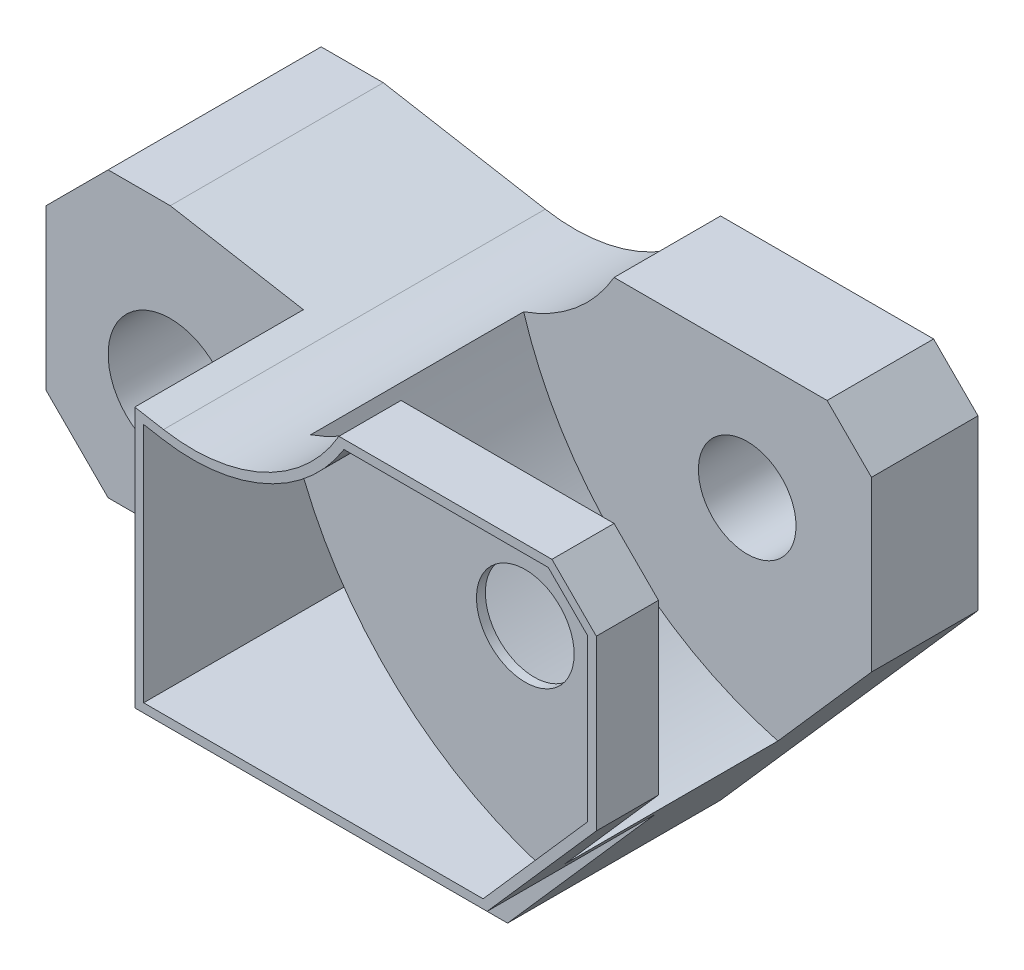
ISO-10303-21;
HEADER;
FILE_DESCRIPTION(('STEP AP214'),'2;1');
FILE_NAME('part.step','',(''),(''),'','','');
FILE_SCHEMA(('AUTOMOTIVE_DESIGN { 1 0 10303 214 1 1 1 1 }'));
ENDSEC;
DATA;
#1=APPLICATION_CONTEXT('core data for automotive mechanical design processes');
#2=APPLICATION_PROTOCOL_DEFINITION('international standard','automotive_design',2000,#1);
#3=PRODUCT_CONTEXT('',#1,'mechanical');
#4=PRODUCT('Part','Part','',(#3));
#5=PRODUCT_RELATED_PRODUCT_CATEGORY('part','',(#4));
#6=PRODUCT_DEFINITION_FORMATION('','',#4);
#7=PRODUCT_DEFINITION_CONTEXT('part definition',#1,'design');
#8=PRODUCT_DEFINITION('design','',#6,#7);
#9=PRODUCT_DEFINITION_SHAPE('','',#8);
#10=(LENGTH_UNIT() NAMED_UNIT(*) SI_UNIT(.MILLI.,.METRE.));
#11=(NAMED_UNIT(*) PLANE_ANGLE_UNIT() SI_UNIT($,.RADIAN.));
#12=(NAMED_UNIT(*) SI_UNIT($,.STERADIAN.) SOLID_ANGLE_UNIT());
#13=UNCERTAINTY_MEASURE_WITH_UNIT(LENGTH_MEASURE(1.E-05),#10,'distance_accuracy_value','');
#14=(GEOMETRIC_REPRESENTATION_CONTEXT(3) GLOBAL_UNCERTAINTY_ASSIGNED_CONTEXT((#13)) GLOBAL_UNIT_ASSIGNED_CONTEXT((#10,
#11,#12)) REPRESENTATION_CONTEXT('',''));
#15=CARTESIAN_POINT('',(0.,0.,0.));
#16=DIRECTION('',(0.,0.,1.));
#17=DIRECTION('',(1.,0.,0.));
#18=AXIS2_PLACEMENT_3D('',#15,#16,#17);
#19=CARTESIAN_POINT('',(21.5424003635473,33.4945992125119,43.));
#20=DIRECTION('',(0.,0.,-1.));
#21=DIRECTION('',(-1.,0.,0.));
#22=AXIS2_PLACEMENT_3D('',#19,#20,#21);
#23=PLANE('',#22);
#24=DIRECTION('',(1.,0.,0.));
#25=VECTOR('',#24,1.);
#26=CARTESIAN_POINT('',(21.0666262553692,-14.,43.));
#27=LINE('',#26,#25);
#28=CARTESIAN_POINT('',(15.,-14.,43.));
#29=VERTEX_POINT('',#28);
#30=CARTESIAN_POINT('',(54.6969696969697,-14.,43.));
#31=VERTEX_POINT('',#30);
#32=EDGE_CURVE('E431',#29,#31,#27,.T.);
#33=ORIENTED_EDGE('',*,*,#32,.T.);
#34=DIRECTION('',(0.660114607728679,0.751164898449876,0.));
#35=VECTOR('',#34,1.);
#36=CARTESIAN_POINT('',(67.,0.,43.));
#37=LINE('',#36,#35);
#38=CARTESIAN_POINT('',(67.,0.,43.));
#39=VERTEX_POINT('',#38);
#40=EDGE_CURVE('E433',#31,#39,#37,.T.);
#41=ORIENTED_EDGE('',*,*,#40,.T.);
#42=DIRECTION('',(0.,1.,0.));
#43=VECTOR('',#42,1.);
#44=CARTESIAN_POINT('',(67.,19.,43.));
#45=LINE('',#44,#43);
#46=CARTESIAN_POINT('',(67.,19.,43.));
#47=VERTEX_POINT('',#46);
#48=EDGE_CURVE('E436',#39,#47,#45,.T.);
#49=ORIENTED_EDGE('',*,*,#48,.T.);
#50=DIRECTION('',(-0.707106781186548,0.707106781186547,0.));
#51=VECTOR('',#50,1.);
#52=CARTESIAN_POINT('',(62.,24.,43.));
#53=LINE('',#52,#51);
#54=CARTESIAN_POINT('',(62.,24.,43.));
#55=VERTEX_POINT('',#54);
#56=EDGE_CURVE('E438',#47,#55,#53,.T.);
#57=ORIENTED_EDGE('',*,*,#56,.T.);
#58=DIRECTION('',(-1.,0.,0.));
#59=VECTOR('',#58,1.);
#60=CARTESIAN_POINT('',(38.,24.,43.));
#61=LINE('',#60,#59);
#62=CARTESIAN_POINT('',(38.,24.,43.));
#63=VERTEX_POINT('',#62);
#64=EDGE_CURVE('E440',#55,#63,#61,.T.);
#65=ORIENTED_EDGE('',*,*,#64,.T.);
#66=CARTESIAN_POINT('',(21.5424003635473,33.4945992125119,43.));
#67=DIRECTION('',(0.,0.,-1.));
#68=DIRECTION('',(-1.,0.,0.));
#69=AXIS2_PLACEMENT_3D('',#66,#67,#68);
#70=CIRCLE('',#69,19.);
#71=CARTESIAN_POINT('',(18.2430849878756,14.78325190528,43.));
#72=VERTEX_POINT('',#71);
#73=EDGE_CURVE('E442',#63,#72,#70,.T.);
#74=ORIENTED_EDGE('',*,*,#73,.T.);
#75=DIRECTION('',(-0.984807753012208,0.173648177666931,0.));
#76=VECTOR('',#75,1.);
#77=CARTESIAN_POINT('',(0.,18.,43.));
#78=LINE('',#77,#76);
#79=CARTESIAN_POINT('',(15.,15.355095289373,43.));
#80=VERTEX_POINT('',#79);
#81=EDGE_CURVE('E444',#72,#80,#78,.T.);
#82=ORIENTED_EDGE('',*,*,#81,.T.);
#83=DIRECTION('',(0.,1.,0.));
#84=VECTOR('',#83,1.);
#85=CARTESIAN_POINT('',(15.,0.,43.));
#86=LINE('',#85,#84);
#87=EDGE_CURVE('E389',#29,#80,#86,.T.);
#88=ORIENTED_EDGE('',*,*,#87,.F.);
#89=EDGE_LOOP('',(#33,#41,#49,#57,#65,#74,#82,#88));
#90=FACE_BOUND('',#89,.T.);
#91=DIRECTION('',(0.660114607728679,0.751164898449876,0.));
#92=VECTOR('',#91,1.);
#93=CARTESIAN_POINT('',(37.0534983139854,-32.5621651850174,43.));
#94=LINE('',#93,#92);
#95=CARTESIAN_POINT('',(54.2444919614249,-13.,43.));
#96=VERTEX_POINT('',#95);
#97=CARTESIAN_POINT('',(66.,0.376957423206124,43.));
#98=VERTEX_POINT('',#97);
#99=EDGE_CURVE('E327',#96,#98,#94,.T.);
#100=ORIENTED_EDGE('',*,*,#99,.F.);
#101=DIRECTION('',(1.,0.,0.));
#102=VECTOR('',#101,1.);
#103=CARTESIAN_POINT('',(0.,-13.,43.));
#104=LINE('',#103,#102);
#105=CARTESIAN_POINT('',(16.,-13.,43.));
#106=VERTEX_POINT('',#105);
#107=EDGE_CURVE('E277',#106,#96,#104,.T.);
#108=ORIENTED_EDGE('',*,*,#107,.F.);
#109=DIRECTION('',(0.,1.,0.));
#110=VECTOR('',#109,1.);
#111=CARTESIAN_POINT('',(16.,0.,43.));
#112=LINE('',#111,#110);
#113=CARTESIAN_POINT('',(16.,14.1633416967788,43.));
#114=VERTEX_POINT('',#113);
#115=EDGE_CURVE('E280',#106,#114,#112,.T.);
#116=ORIENTED_EDGE('',*,*,#115,.T.);
#117=DIRECTION('',(-0.984807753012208,0.173648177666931,0.));
#118=VECTOR('',#117,1.);
#119=CARTESIAN_POINT('',(2.90453311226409,16.472425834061,43.));
#120=LINE('',#119,#118);
#121=CARTESIAN_POINT('',(18.0694368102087,13.7984441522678,43.));
#122=VERTEX_POINT('',#121);
#123=EDGE_CURVE('E289',#122,#114,#120,.T.);
#124=ORIENTED_EDGE('',*,*,#123,.F.);
#125=CARTESIAN_POINT('',(21.5424003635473,33.4945992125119,43.));
#126=DIRECTION('',(0.,0.,1.));
#127=DIRECTION('',(1.,0.,0.));
#128=AXIS2_PLACEMENT_3D('',#125,#126,#127);
#129=CIRCLE('',#128,20.);
#130=CARTESIAN_POINT('',(38.5677751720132,23.,43.));
#131=VERTEX_POINT('',#130);
#132=EDGE_CURVE('E296',#122,#131,#129,.T.);
#133=ORIENTED_EDGE('',*,*,#132,.T.);
#134=DIRECTION('',(-1.,0.,0.));
#135=VECTOR('',#134,1.);
#136=CARTESIAN_POINT('',(0.,23.,43.));
#137=LINE('',#136,#135);
#138=CARTESIAN_POINT('',(61.5857864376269,23.,43.));
#139=VERTEX_POINT('',#138);
#140=EDGE_CURVE('E309',#139,#131,#137,.T.);
#141=ORIENTED_EDGE('',*,*,#140,.F.);
#142=DIRECTION('',(-0.707106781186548,0.707106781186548,0.));
#143=VECTOR('',#142,1.);
#144=CARTESIAN_POINT('',(42.2928932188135,42.2928932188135,43.));
#145=LINE('',#144,#143);
#146=CARTESIAN_POINT('',(66.,18.5857864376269,43.));
#147=VERTEX_POINT('',#146);
#148=EDGE_CURVE('E333',#147,#139,#145,.T.);
#149=ORIENTED_EDGE('',*,*,#148,.F.);
#150=DIRECTION('',(0.,1.,0.));
#151=VECTOR('',#150,1.);
#152=CARTESIAN_POINT('',(66.,0.,43.));
#153=LINE('',#152,#151);
#154=EDGE_CURVE('E330',#98,#147,#153,.T.);
#155=ORIENTED_EDGE('',*,*,#154,.F.);
#156=EDGE_LOOP('',(#100,#108,#116,#124,#133,#141,#149,#155));
#157=FACE_BOUND('',#156,.T.);
#158=ADVANCED_FACE('F37',(#90,#157),#23,.F.);
#159=CARTESIAN_POINT('',(53.,10.,0.));
#160=DIRECTION('',(0.,0.,1.));
#161=DIRECTION('',(1.,0.,0.));
#162=AXIS2_PLACEMENT_3D('',#159,#160,#161);
#163=CYLINDRICAL_SURFACE('',#162,5.5);
#164=CARTESIAN_POINT('',(53.,10.,36.));
#165=DIRECTION('',(0.,0.,1.));
#166=DIRECTION('',(1.,0.,0.));
#167=AXIS2_PLACEMENT_3D('',#164,#165,#166);
#168=CIRCLE('',#167,5.5);
#169=CARTESIAN_POINT('',(58.5,10.,36.));
#170=VERTEX_POINT('',#169);
#171=EDGE_CURVE('E340',#170,#170,#168,.T.);
#172=ORIENTED_EDGE('',*,*,#171,.F.);
#173=EDGE_LOOP('',(#172));
#174=FACE_BOUND('',#173,.T.);
#175=CARTESIAN_POINT('',(53.,10.,37.));
#176=DIRECTION('',(0.,0.,1.));
#177=DIRECTION('',(1.,0.,0.));
#178=AXIS2_PLACEMENT_3D('',#175,#176,#177);
#179=CIRCLE('',#178,5.5);
#180=CARTESIAN_POINT('',(58.5,10.,37.));
#181=VERTEX_POINT('',#180);
#182=EDGE_CURVE('E305',#181,#181,#179,.F.);
#183=ORIENTED_EDGE('',*,*,#182,.F.);
#184=EDGE_LOOP('',(#183));
#185=FACE_BOUND('',#184,.T.);
#186=ADVANCED_FACE('F632',(#174,#185),#163,.F.);
#187=CARTESIAN_POINT('',(67.,0.,43.));
#188=DIRECTION('',(-0.751164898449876,0.660114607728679,0.));
#189=DIRECTION('',(-0.660114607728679,-0.751164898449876,0.));
#190=AXIS2_PLACEMENT_3D('',#187,#188,#189);
#191=PLANE('',#190);
#192=DIRECTION('',(0.660114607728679,0.751164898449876,0.));
#193=VECTOR('',#192,1.);
#194=CARTESIAN_POINT('',(37.8046632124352,-33.2222797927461,12.));
#195=LINE('',#194,#193);
#196=CARTESIAN_POINT('',(56.4545454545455,-12.,12.));
#197=VERTEX_POINT('',#196);
#198=CARTESIAN_POINT('',(67.,0.,12.));
#199=VERTEX_POINT('',#198);
#200=EDGE_CURVE('E356',#197,#199,#195,.T.);
#201=ORIENTED_EDGE('',*,*,#200,.F.);
#202=DIRECTION('',(0.,0.,1.));
#203=VECTOR('',#202,1.);
#204=CARTESIAN_POINT('',(56.4545454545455,-12.,12.));
#205=LINE('',#204,#203);
#206=CARTESIAN_POINT('',(56.4545454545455,-12.,36.));
#207=VERTEX_POINT('',#206);
#208=EDGE_CURVE('E382',#197,#207,#205,.T.);
#209=ORIENTED_EDGE('',*,*,#208,.T.);
#210=DIRECTION('',(0.660114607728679,0.751164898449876,0.));
#211=VECTOR('',#210,1.);
#212=CARTESIAN_POINT('',(37.8046632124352,-33.2222797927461,36.));
#213=LINE('',#212,#211);
#214=CARTESIAN_POINT('',(67.,0.,36.));
#215=VERTEX_POINT('',#214);
#216=EDGE_CURVE('E371',#207,#215,#213,.T.);
#217=ORIENTED_EDGE('',*,*,#216,.T.);
#218=DIRECTION('',(0.,0.,-1.));
#219=VECTOR('',#218,1.);
#220=CARTESIAN_POINT('',(67.,0.,43.));
#221=LINE('',#220,#219);
#222=EDGE_CURVE('E510',#39,#215,#221,.T.);
#223=ORIENTED_EDGE('',*,*,#222,.F.);
#224=ORIENTED_EDGE('',*,*,#40,.F.);
#225=DIRECTION('',(0.,0.,1.));
#226=VECTOR('',#225,1.);
#227=CARTESIAN_POINT('',(54.6969696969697,-14.,24.));
#228=LINE('',#227,#226);
#229=CARTESIAN_POINT('',(54.6969696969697,-14.,24.));
#230=VERTEX_POINT('',#229);
#231=EDGE_CURVE('E400',#230,#31,#228,.T.);
#232=ORIENTED_EDGE('',*,*,#231,.F.);
#233=DIRECTION('',(0.660114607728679,0.751164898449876,0.));
#234=VECTOR('',#233,1.);
#235=CARTESIAN_POINT('',(37.8046632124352,-33.2222797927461,24.));
#236=LINE('',#235,#234);
#237=CARTESIAN_POINT('',(38.,-33.,24.));
#238=VERTEX_POINT('',#237);
#239=EDGE_CURVE('E398',#238,#230,#236,.T.);
#240=ORIENTED_EDGE('',*,*,#239,.F.);
#241=DIRECTION('',(0.,0.,-1.));
#242=VECTOR('',#241,1.);
#243=CARTESIAN_POINT('',(38.,-33.,43.));
#244=LINE('',#243,#242);
#245=CARTESIAN_POINT('',(38.,-33.,0.));
#246=VERTEX_POINT('',#245);
#247=EDGE_CURVE('E513',#238,#246,#244,.T.);
#248=ORIENTED_EDGE('',*,*,#247,.T.);
#249=DIRECTION('',(0.660114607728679,0.751164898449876,0.));
#250=VECTOR('',#249,1.);
#251=CARTESIAN_POINT('',(67.,0.,0.));
#252=LINE('',#251,#250);
#253=CARTESIAN_POINT('',(67.,0.,0.));
#254=VERTEX_POINT('',#253);
#255=EDGE_CURVE('E462',#246,#254,#252,.T.);
#256=ORIENTED_EDGE('',*,*,#255,.T.);
#257=EDGE_CURVE('E509',#199,#254,#221,.T.);
#258=ORIENTED_EDGE('',*,*,#257,.F.);
#259=EDGE_LOOP('',(#201,#209,#217,#223,#224,#232,#240,#248,#256,#258));
#260=FACE_BOUND('',#259,.T.);
#261=ADVANCED_FACE('F547',(#260),#191,.F.);
#262=CARTESIAN_POINT('',(67.,19.,43.));
#263=DIRECTION('',(-1.,0.,0.));
#264=DIRECTION('',(0.,0.,1.));
#265=AXIS2_PLACEMENT_3D('',#262,#263,#264);
#266=PLANE('',#265);
#267=DIRECTION('',(0.,1.,0.));
#268=VECTOR('',#267,1.);
#269=CARTESIAN_POINT('',(67.,0.,12.));
#270=LINE('',#269,#268);
#271=CARTESIAN_POINT('',(67.,19.,12.));
#272=VERTEX_POINT('',#271);
#273=EDGE_CURVE('E358',#199,#272,#270,.T.);
#274=ORIENTED_EDGE('',*,*,#273,.F.);
#275=ORIENTED_EDGE('',*,*,#257,.T.);
#276=DIRECTION('',(0.,1.,0.));
#277=VECTOR('',#276,1.);
#278=CARTESIAN_POINT('',(67.,19.,0.));
#279=LINE('',#278,#277);
#280=CARTESIAN_POINT('',(67.,19.,0.));
#281=VERTEX_POINT('',#280);
#282=EDGE_CURVE('E465',#254,#281,#279,.T.);
#283=ORIENTED_EDGE('',*,*,#282,.T.);
#284=DIRECTION('',(0.,0.,-1.));
#285=VECTOR('',#284,1.);
#286=CARTESIAN_POINT('',(67.,19.,43.));
#287=LINE('',#286,#285);
#288=EDGE_CURVE('E505',#272,#281,#287,.T.);
#289=ORIENTED_EDGE('',*,*,#288,.F.);
#290=EDGE_LOOP('',(#274,#275,#283,#289));
#291=FACE_BOUND('',#290,.T.);
#292=ADVANCED_FACE('F606',(#291),#266,.F.);
#293=CARTESIAN_POINT('',(62.,24.,43.));
#294=DIRECTION('',(-0.707106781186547,-0.707106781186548,0.));
#295=DIRECTION('',(0.707106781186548,-0.707106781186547,0.));
#296=AXIS2_PLACEMENT_3D('',#293,#294,#295);
#297=PLANE('',#296);
#298=DIRECTION('',(-0.707106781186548,0.707106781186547,0.));
#299=VECTOR('',#298,1.);
#300=CARTESIAN_POINT('',(43.,43.,12.));
#301=LINE('',#300,#299);
#302=CARTESIAN_POINT('',(62.,24.,12.));
#303=VERTEX_POINT('',#302);
#304=EDGE_CURVE('E360',#272,#303,#301,.T.);
#305=ORIENTED_EDGE('',*,*,#304,.F.);
#306=ORIENTED_EDGE('',*,*,#288,.T.);
#307=DIRECTION('',(-0.707106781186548,0.707106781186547,0.));
#308=VECTOR('',#307,1.);
#309=CARTESIAN_POINT('',(62.,24.,0.));
#310=LINE('',#309,#308);
#311=CARTESIAN_POINT('',(62.,24.,0.));
#312=VERTEX_POINT('',#311);
#313=EDGE_CURVE('E468',#281,#312,#310,.T.);
#314=ORIENTED_EDGE('',*,*,#313,.T.);
#315=DIRECTION('',(0.,0.,-1.));
#316=VECTOR('',#315,1.);
#317=CARTESIAN_POINT('',(62.,24.,43.));
#318=LINE('',#317,#316);
#319=EDGE_CURVE('E501',#303,#312,#318,.T.);
#320=ORIENTED_EDGE('',*,*,#319,.F.);
#321=EDGE_LOOP('',(#305,#306,#314,#320));
#322=FACE_BOUND('',#321,.T.);
#323=ADVANCED_FACE('F602',(#322),#297,.F.);
#324=CARTESIAN_POINT('',(38.,24.,43.));
#325=DIRECTION('',(0.,-1.,0.));
#326=DIRECTION('',(0.,0.,-1.));
#327=AXIS2_PLACEMENT_3D('',#324,#325,#326);
#328=PLANE('',#327);
#329=DIRECTION('',(-1.,0.,0.));
#330=VECTOR('',#329,1.);
#331=CARTESIAN_POINT('',(0.,24.,12.));
#332=LINE('',#331,#330);
#333=CARTESIAN_POINT('',(38.,24.,12.));
#334=VERTEX_POINT('',#333);
#335=EDGE_CURVE('E362',#303,#334,#332,.T.);
#336=ORIENTED_EDGE('',*,*,#335,.F.);
#337=ORIENTED_EDGE('',*,*,#319,.T.);
#338=DIRECTION('',(-1.,0.,0.));
#339=VECTOR('',#338,1.);
#340=CARTESIAN_POINT('',(38.,24.,0.));
#341=LINE('',#340,#339);
#342=CARTESIAN_POINT('',(38.,24.,0.));
#343=VERTEX_POINT('',#342);
#344=EDGE_CURVE('E471',#312,#343,#341,.T.);
#345=ORIENTED_EDGE('',*,*,#344,.T.);
#346=DIRECTION('',(0.,0.,-1.));
#347=VECTOR('',#346,1.);
#348=CARTESIAN_POINT('',(38.,24.,43.));
#349=LINE('',#348,#347);
#350=EDGE_CURVE('E497',#334,#343,#349,.T.);
#351=ORIENTED_EDGE('',*,*,#350,.F.);
#352=EDGE_LOOP('',(#336,#337,#345,#351));
#353=FACE_BOUND('',#352,.T.);
#354=ADVANCED_FACE('F597',(#353),#328,.F.);
#355=CARTESIAN_POINT('',(21.5424003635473,33.4945992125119,43.));
#356=DIRECTION('',(0.,0.,-1.));
#357=DIRECTION('',(-1.,0.,0.));
#358=AXIS2_PLACEMENT_3D('',#355,#356,#357);
#359=CYLINDRICAL_SURFACE('',#358,19.);
#360=CARTESIAN_POINT('',(21.5424003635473,33.4945992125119,12.));
#361=DIRECTION('',(0.,0.,1.));
#362=DIRECTION('',(1.,0.,0.));
#363=AXIS2_PLACEMENT_3D('',#360,#361,#362);
#364=CIRCLE('',#363,19.);
#365=CARTESIAN_POINT('',(27.8141459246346,15.5595718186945,12.));
#366=VERTEX_POINT('',#365);
#367=EDGE_CURVE('E349',#334,#366,#364,.F.);
#368=ORIENTED_EDGE('',*,*,#367,.F.);
#369=ORIENTED_EDGE('',*,*,#350,.T.);
#370=CARTESIAN_POINT('',(21.5424003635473,33.4945992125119,0.));
#371=DIRECTION('',(0.,0.,-1.));
#372=DIRECTION('',(-1.,0.,0.));
#373=AXIS2_PLACEMENT_3D('',#370,#371,#372);
#374=CIRCLE('',#373,19.);
#375=CARTESIAN_POINT('',(18.2430849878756,14.78325190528,0.));
#376=VERTEX_POINT('',#375);
#377=EDGE_CURVE('E474',#343,#376,#374,.T.);
#378=ORIENTED_EDGE('',*,*,#377,.T.);
#379=DIRECTION('',(0.,0.,-1.));
#380=VECTOR('',#379,1.);
#381=CARTESIAN_POINT('',(18.2430849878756,14.78325190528,43.));
#382=LINE('',#381,#380);
#383=EDGE_CURVE('E494',#72,#376,#382,.T.);
#384=ORIENTED_EDGE('',*,*,#383,.F.);
#385=ORIENTED_EDGE('',*,*,#73,.F.);
#386=CARTESIAN_POINT('',(38.,24.,36.));
#387=VERTEX_POINT('',#386);
#388=EDGE_CURVE('E498',#63,#387,#349,.T.);
#389=ORIENTED_EDGE('',*,*,#388,.T.);
#390=CARTESIAN_POINT('',(21.5424003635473,33.4945992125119,36.));
#391=DIRECTION('',(0.,0.,1.));
#392=DIRECTION('',(1.,0.,0.));
#393=AXIS2_PLACEMENT_3D('',#390,#391,#392);
#394=CIRCLE('',#393,19.);
#395=CARTESIAN_POINT('',(27.8141459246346,15.5595718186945,36.));
#396=VERTEX_POINT('',#395);
#397=EDGE_CURVE('E367',#387,#396,#394,.F.);
#398=ORIENTED_EDGE('',*,*,#397,.T.);
#399=DIRECTION('',(0.,0.,1.));
#400=VECTOR('',#399,1.);
#401=CARTESIAN_POINT('',(27.8141459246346,15.5595718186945,12.));
#402=LINE('',#401,#400);
#403=EDGE_CURVE('E364',#366,#396,#402,.T.);
#404=ORIENTED_EDGE('',*,*,#403,.F.);
#405=EDGE_LOOP('',(#368,#369,#378,#384,#385,#389,#398,#404));
#406=FACE_BOUND('',#405,.T.);
#407=ADVANCED_FACE('F592',(#406),#359,.F.);
#408=CARTESIAN_POINT('',(53.,10.,0.));
#409=DIRECTION('',(0.,0.,1.));
#410=DIRECTION('',(1.,0.,0.));
#411=AXIS2_PLACEMENT_3D('',#408,#409,#410);
#412=CIRCLE('',#411,5.5);
#413=CARTESIAN_POINT('',(58.5,10.,0.));
#414=VERTEX_POINT('',#413);
#415=EDGE_CURVE('E385',#414,#414,#412,.T.);
#416=ORIENTED_EDGE('',*,*,#415,.F.);
#417=EDGE_LOOP('',(#416));
#418=FACE_BOUND('',#417,.T.);
#419=CARTESIAN_POINT('',(53.,10.,12.));
#420=DIRECTION('',(0.,0.,1.));
#421=DIRECTION('',(1.,0.,0.));
#422=AXIS2_PLACEMENT_3D('',#419,#420,#421);
#423=CIRCLE('',#422,5.5);
#424=CARTESIAN_POINT('',(58.5,10.,12.));
#425=VERTEX_POINT('',#424);
#426=EDGE_CURVE('E346',#425,#425,#423,.T.);
#427=ORIENTED_EDGE('',*,*,#426,.T.);
#428=EDGE_LOOP('',(#427));
#429=FACE_BOUND('',#428,.T.);
#430=ADVANCED_FACE('F639',(#418,#429),#163,.F.);
#431=CARTESIAN_POINT('',(-7.00000000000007,-14.,43.));
#432=DIRECTION('',(0.707106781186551,0.707106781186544,0.));
#433=DIRECTION('',(-0.707106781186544,0.707106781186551,0.));
#434=AXIS2_PLACEMENT_3D('',#431,#432,#433);
#435=PLANE('',#434);
#436=DIRECTION('',(0.707106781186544,-0.707106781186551,0.));
#437=VECTOR('',#436,1.);
#438=CARTESIAN_POINT('',(-10.5000000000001,-10.5,24.));
#439=LINE('',#438,#437);
#440=CARTESIAN_POINT('',(-14.,-7.,24.));
#441=VERTEX_POINT('',#440);
#442=CARTESIAN_POINT('',(-7.00000000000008,-14.,24.));
#443=VERTEX_POINT('',#442);
#444=EDGE_CURVE('E421',#441,#443,#439,.T.);
#445=ORIENTED_EDGE('',*,*,#444,.F.);
#446=DIRECTION('',(0.,0.,-1.));
#447=VECTOR('',#446,1.);
#448=CARTESIAN_POINT('',(-14.,-7.,43.));
#449=LINE('',#448,#447);
#450=CARTESIAN_POINT('',(-14.,-7.,0.));
#451=VERTEX_POINT('',#450);
#452=EDGE_CURVE('E447',#441,#451,#449,.T.);
#453=ORIENTED_EDGE('',*,*,#452,.T.);
#454=DIRECTION('',(0.707106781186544,-0.707106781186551,0.));
#455=VECTOR('',#454,1.);
#456=CARTESIAN_POINT('',(-7.00000000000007,-14.,0.));
#457=LINE('',#456,#455);
#458=CARTESIAN_POINT('',(-7.00000000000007,-14.,0.));
#459=VERTEX_POINT('',#458);
#460=EDGE_CURVE('E430',#451,#459,#457,.T.);
#461=ORIENTED_EDGE('',*,*,#460,.T.);
#462=DIRECTION('',(0.,0.,-1.));
#463=VECTOR('',#462,1.);
#464=CARTESIAN_POINT('',(-7.00000000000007,-14.,43.));
#465=LINE('',#464,#463);
#466=EDGE_CURVE('E11',#443,#459,#465,.T.);
#467=ORIENTED_EDGE('',*,*,#466,.F.);
#468=EDGE_LOOP('',(#445,#453,#461,#467));
#469=FACE_BOUND('',#468,.T.);
#470=ADVANCED_FACE('F39',(#469),#435,.F.);
#471=CARTESIAN_POINT('',(21.0666262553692,-19.,43.));
#472=DIRECTION('',(0.,0.,-1.));
#473=DIRECTION('',(-1.,0.,0.));
#474=AXIS2_PLACEMENT_3D('',#471,#472,#473);
#475=CYLINDRICAL_SURFACE('',#474,5.);
#476=CARTESIAN_POINT('',(21.0666262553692,-19.,24.));
#477=DIRECTION('',(0.,0.,1.));
#478=DIRECTION('',(1.,0.,0.));
#479=AXIS2_PLACEMENT_3D('',#476,#477,#478);
#480=CIRCLE('',#479,5.);
#481=CARTESIAN_POINT('',(21.0666262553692,-14.,24.));
#482=VERTEX_POINT('',#481);
#483=CARTESIAN_POINT('',(26.0122649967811,-18.2647058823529,24.));
#484=VERTEX_POINT('',#483);
#485=EDGE_CURVE('E392',#482,#484,#480,.F.);
#486=ORIENTED_EDGE('',*,*,#485,.F.);
#487=DIRECTION('',(0.,0.,-1.));
#488=VECTOR('',#487,1.);
#489=CARTESIAN_POINT('',(21.0666262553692,-14.,43.));
#490=LINE('',#489,#488);
#491=CARTESIAN_POINT('',(21.0666262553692,-14.,0.));
#492=VERTEX_POINT('',#491);
#493=EDGE_CURVE('E45',#482,#492,#490,.T.);
#494=ORIENTED_EDGE('',*,*,#493,.T.);
#495=CARTESIAN_POINT('',(21.0666262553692,-19.,0.));
#496=DIRECTION('',(0.,0.,-1.));
#497=DIRECTION('',(1.,0.,0.));
#498=AXIS2_PLACEMENT_3D('',#495,#496,#497);
#499=CIRCLE('',#498,5.);
#500=CARTESIAN_POINT('',(26.0122649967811,-18.2647058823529,0.));
#501=VERTEX_POINT('',#500);
#502=EDGE_CURVE('E453',#492,#501,#499,.T.);
#503=ORIENTED_EDGE('',*,*,#502,.T.);
#504=DIRECTION('',(0.,0.,-1.));
#505=VECTOR('',#504,1.);
#506=CARTESIAN_POINT('',(26.0122649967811,-18.2647058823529,43.));
#507=LINE('',#506,#505);
#508=EDGE_CURVE('E517',#484,#501,#507,.T.);
#509=ORIENTED_EDGE('',*,*,#508,.F.);
#510=EDGE_LOOP('',(#486,#494,#503,#509));
#511=FACE_BOUND('',#510,.T.);
#512=ADVANCED_FACE('F521',(#511),#475,.F.);
#513=CARTESIAN_POINT('',(54.6969696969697,-14.,43.));
#514=DIRECTION('',(0.,0.,-1.));
#515=DIRECTION('',(-1.,0.,0.));
#516=AXIS2_PLACEMENT_3D('',#513,#514,#515);
#517=CYLINDRICAL_SURFACE('',#516,29.);
#518=CARTESIAN_POINT('',(54.6969696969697,-14.,24.));
#519=DIRECTION('',(0.,0.,1.));
#520=DIRECTION('',(1.,0.,0.));
#521=AXIS2_PLACEMENT_3D('',#518,#519,#520);
#522=CIRCLE('',#521,29.);
#523=CARTESIAN_POINT('',(32.788067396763,-33.,24.));
#524=VERTEX_POINT('',#523);
#525=EDGE_CURVE('E395',#484,#524,#522,.T.);
#526=ORIENTED_EDGE('',*,*,#525,.F.);
#527=ORIENTED_EDGE('',*,*,#508,.T.);
#528=CARTESIAN_POINT('',(54.6969696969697,-14.,0.));
#529=DIRECTION('',(0.,0.,1.));
#530=DIRECTION('',(-1.,0.,0.));
#531=AXIS2_PLACEMENT_3D('',#528,#529,#530);
#532=CIRCLE('',#531,29.);
#533=CARTESIAN_POINT('',(32.788067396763,-33.,0.));
#534=VERTEX_POINT('',#533);
#535=EDGE_CURVE('E456',#501,#534,#532,.T.);
#536=ORIENTED_EDGE('',*,*,#535,.T.);
#537=DIRECTION('',(0.,0.,-1.));
#538=VECTOR('',#537,1.);
#539=CARTESIAN_POINT('',(32.788067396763,-33.,43.));
#540=LINE('',#539,#538);
#541=EDGE_CURVE('E515',#524,#534,#540,.T.);
#542=ORIENTED_EDGE('',*,*,#541,.F.);
#543=EDGE_LOOP('',(#526,#527,#536,#542));
#544=FACE_BOUND('',#543,.T.);
#545=ADVANCED_FACE('F540',(#544),#517,.T.);
#546=CARTESIAN_POINT('',(38.,-33.,43.));
#547=DIRECTION('',(0.,1.,0.));
#548=DIRECTION('',(-1.,0.,0.));
#549=AXIS2_PLACEMENT_3D('',#546,#547,#548);
#550=PLANE('',#549);
#551=DIRECTION('',(1.,0.,0.));
#552=VECTOR('',#551,1.);
#553=CARTESIAN_POINT('',(0.,-32.9999999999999,24.));
#554=LINE('',#553,#552);
#555=EDGE_CURVE('E60',#524,#238,#554,.T.);
#556=ORIENTED_EDGE('',*,*,#555,.F.);
#557=ORIENTED_EDGE('',*,*,#541,.T.);
#558=DIRECTION('',(1.,0.,0.));
#559=VECTOR('',#558,1.);
#560=CARTESIAN_POINT('',(38.,-33.,0.));
#561=LINE('',#560,#559);
#562=EDGE_CURVE('E459',#534,#246,#561,.T.);
#563=ORIENTED_EDGE('',*,*,#562,.T.);
#564=ORIENTED_EDGE('',*,*,#247,.F.);
#565=EDGE_LOOP('',(#556,#557,#563,#564));
#566=FACE_BOUND('',#565,.T.);
#567=ADVANCED_FACE('F544',(#566),#550,.F.);
#568=CARTESIAN_POINT('',(-6.99999999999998,18.,43.));
#569=DIRECTION('',(0.,-1.,0.));
#570=DIRECTION('',(0.,0.,-1.));
#571=AXIS2_PLACEMENT_3D('',#568,#569,#570);
#572=PLANE('',#571);
#573=DIRECTION('',(-1.,0.,0.));
#574=VECTOR('',#573,1.);
#575=CARTESIAN_POINT('',(0.,18.,24.));
#576=LINE('',#575,#574);
#577=CARTESIAN_POINT('',(0.,18.,24.));
#578=VERTEX_POINT('',#577);
#579=CARTESIAN_POINT('',(-6.99999999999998,18.,24.));
#580=VERTEX_POINT('',#579);
#581=EDGE_CURVE('E415',#578,#580,#576,.T.);
#582=ORIENTED_EDGE('',*,*,#581,.F.);
#583=DIRECTION('',(0.,0.,-1.));
#584=VECTOR('',#583,1.);
#585=CARTESIAN_POINT('',(0.,18.,43.));
#586=LINE('',#585,#584);
#587=CARTESIAN_POINT('',(0.,18.,0.));
#588=VERTEX_POINT('',#587);
#589=EDGE_CURVE('E492',#578,#588,#586,.T.);
#590=ORIENTED_EDGE('',*,*,#589,.T.);
#591=DIRECTION('',(-1.,0.,0.));
#592=VECTOR('',#591,1.);
#593=CARTESIAN_POINT('',(-6.99999999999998,18.,0.));
#594=LINE('',#593,#592);
#595=CARTESIAN_POINT('',(-6.99999999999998,18.,0.));
#596=VERTEX_POINT('',#595);
#597=EDGE_CURVE('E479',#588,#596,#594,.T.);
#598=ORIENTED_EDGE('',*,*,#597,.T.);
#599=DIRECTION('',(0.,0.,-1.));
#600=VECTOR('',#599,1.);
#601=CARTESIAN_POINT('',(-6.99999999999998,18.,43.));
#602=LINE('',#601,#600);
#603=EDGE_CURVE('E490',#580,#596,#602,.T.);
#604=ORIENTED_EDGE('',*,*,#603,.F.);
#605=EDGE_LOOP('',(#582,#590,#598,#604));
#606=FACE_BOUND('',#605,.T.);
#607=ADVANCED_FACE('F572',(#606),#572,.F.);
#608=CARTESIAN_POINT('',(-14.,11.,43.));
#609=DIRECTION('',(0.707106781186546,-0.707106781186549,0.));
#610=DIRECTION('',(0.707106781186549,0.707106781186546,0.));
#611=AXIS2_PLACEMENT_3D('',#608,#609,#610);
#612=PLANE('',#611);
#613=DIRECTION('',(-0.707106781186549,-0.707106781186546,0.));
#614=VECTOR('',#613,1.);
#615=CARTESIAN_POINT('',(-12.5,12.5,24.));
#616=LINE('',#615,#614);
#617=CARTESIAN_POINT('',(-14.,11.,24.));
#618=VERTEX_POINT('',#617);
#619=EDGE_CURVE('E417',#580,#618,#616,.T.);
#620=ORIENTED_EDGE('',*,*,#619,.F.);
#621=ORIENTED_EDGE('',*,*,#603,.T.);
#622=DIRECTION('',(-0.707106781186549,-0.707106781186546,0.));
#623=VECTOR('',#622,1.);
#624=CARTESIAN_POINT('',(-14.,11.,0.));
#625=LINE('',#624,#623);
#626=CARTESIAN_POINT('',(-14.,11.,0.));
#627=VERTEX_POINT('',#626);
#628=EDGE_CURVE('E482',#596,#627,#625,.T.);
#629=ORIENTED_EDGE('',*,*,#628,.T.);
#630=DIRECTION('',(0.,0.,-1.));
#631=VECTOR('',#630,1.);
#632=CARTESIAN_POINT('',(-14.,11.,43.));
#633=LINE('',#632,#631);
#634=EDGE_CURVE('E488',#618,#627,#633,.T.);
#635=ORIENTED_EDGE('',*,*,#634,.F.);
#636=EDGE_LOOP('',(#620,#621,#629,#635));
#637=FACE_BOUND('',#636,.T.);
#638=ADVANCED_FACE('F576',(#637),#612,.F.);
#639=CARTESIAN_POINT('',(-14.,-7.,43.));
#640=DIRECTION('',(1.,0.,0.));
#641=DIRECTION('',(0.,0.,-1.));
#642=AXIS2_PLACEMENT_3D('',#639,#640,#641);
#643=PLANE('',#642);
#644=DIRECTION('',(0.,-1.,0.));
#645=VECTOR('',#644,1.);
#646=CARTESIAN_POINT('',(-14.,0.,24.));
#647=LINE('',#646,#645);
#648=EDGE_CURVE('E419',#618,#441,#647,.T.);
#649=ORIENTED_EDGE('',*,*,#648,.F.);
#650=ORIENTED_EDGE('',*,*,#634,.T.);
#651=DIRECTION('',(0.,-1.,0.));
#652=VECTOR('',#651,1.);
#653=CARTESIAN_POINT('',(-14.,-7.,0.));
#654=LINE('',#653,#652);
#655=EDGE_CURVE('E434',#627,#451,#654,.T.);
#656=ORIENTED_EDGE('',*,*,#655,.T.);
#657=ORIENTED_EDGE('',*,*,#452,.F.);
#658=EDGE_LOOP('',(#649,#650,#656,#657));
#659=FACE_BOUND('',#658,.T.);
#660=ADVANCED_FACE('F583',(#659),#643,.F.);
#661=CARTESIAN_POINT('',(0.,0.,43.));
#662=DIRECTION('',(0.,0.,-1.));
#663=DIRECTION('',(-1.,0.,0.));
#664=AXIS2_PLACEMENT_3D('',#661,#662,#663);
#665=CYLINDRICAL_SURFACE('',#664,7.);
#666=CARTESIAN_POINT('',(0.,0.,0.));
#667=DIRECTION('',(0.,0.,1.));
#668=DIRECTION('',(1.,0.,0.));
#669=AXIS2_PLACEMENT_3D('',#666,#667,#668);
#670=CIRCLE('',#669,7.);
#671=CARTESIAN_POINT('',(7.,0.,0.));
#672=VERTEX_POINT('',#671);
#673=EDGE_CURVE('E403',#672,#672,#670,.T.);
#674=ORIENTED_EDGE('',*,*,#673,.F.);
#675=EDGE_LOOP('',(#674));
#676=FACE_BOUND('',#675,.T.);
#677=CARTESIAN_POINT('',(0.,0.,24.));
#678=DIRECTION('',(0.,0.,1.));
#679=DIRECTION('',(1.,0.,0.));
#680=AXIS2_PLACEMENT_3D('',#677,#678,#679);
#681=CIRCLE('',#680,7.);
#682=CARTESIAN_POINT('',(7.,0.,24.));
#683=VERTEX_POINT('',#682);
#684=EDGE_CURVE('E404',#683,#683,#681,.F.);
#685=ORIENTED_EDGE('',*,*,#684,.F.);
#686=EDGE_LOOP('',(#685));
#687=FACE_BOUND('',#686,.T.);
#688=ADVANCED_FACE('F642',(#676,#687),#665,.F.);
#689=CARTESIAN_POINT('',(21.5424003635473,33.4945992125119,0.));
#690=DIRECTION('',(0.,0.,-1.));
#691=DIRECTION('',(-1.,0.,0.));
#692=AXIS2_PLACEMENT_3D('',#689,#690,#691);
#693=PLANE('',#692);
#694=ORIENTED_EDGE('',*,*,#415,.T.);
#695=EDGE_LOOP('',(#694));
#696=FACE_BOUND('',#695,.T.);
#697=ORIENTED_EDGE('',*,*,#460,.F.);
#698=ORIENTED_EDGE('',*,*,#655,.F.);
#699=ORIENTED_EDGE('',*,*,#628,.F.);
#700=ORIENTED_EDGE('',*,*,#597,.F.);
#701=DIRECTION('',(-0.984807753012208,0.173648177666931,0.));
#702=VECTOR('',#701,1.);
#703=CARTESIAN_POINT('',(0.,18.,0.));
#704=LINE('',#703,#702);
#705=EDGE_CURVE('E476',#376,#588,#704,.T.);
#706=ORIENTED_EDGE('',*,*,#705,.F.);
#707=ORIENTED_EDGE('',*,*,#377,.F.);
#708=ORIENTED_EDGE('',*,*,#344,.F.);
#709=ORIENTED_EDGE('',*,*,#313,.F.);
#710=ORIENTED_EDGE('',*,*,#282,.F.);
#711=ORIENTED_EDGE('',*,*,#255,.F.);
#712=ORIENTED_EDGE('',*,*,#562,.F.);
#713=ORIENTED_EDGE('',*,*,#535,.F.);
#714=ORIENTED_EDGE('',*,*,#502,.F.);
#715=DIRECTION('',(1.,0.,0.));
#716=VECTOR('',#715,1.);
#717=CARTESIAN_POINT('',(21.0666262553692,-14.,0.));
#718=LINE('',#717,#716);
#719=EDGE_CURVE('E450',#459,#492,#718,.T.);
#720=ORIENTED_EDGE('',*,*,#719,.F.);
#721=EDGE_LOOP('',(#697,#698,#699,#700,#706,#707,#708,#709,#710,#711,#712,#713,#714,#720));
#722=FACE_BOUND('',#721,.T.);
#723=ORIENTED_EDGE('',*,*,#673,.T.);
#724=EDGE_LOOP('',(#723));
#725=FACE_BOUND('',#724,.T.);
#726=ADVANCED_FACE('F533',(#696,#722,#725),#693,.T.);
#727=CARTESIAN_POINT('',(21.0666262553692,-14.,43.));
#728=DIRECTION('',(0.,1.,0.));
#729=DIRECTION('',(-1.,0.,0.));
#730=AXIS2_PLACEMENT_3D('',#727,#728,#729);
#731=PLANE('',#730);
#732=ORIENTED_EDGE('',*,*,#32,.F.);
#733=DIRECTION('',(0.,0.,1.));
#734=VECTOR('',#733,1.);
#735=CARTESIAN_POINT('',(15.,-14.,24.));
#736=LINE('',#735,#734);
#737=CARTESIAN_POINT('',(15.,-14.,24.));
#738=VERTEX_POINT('',#737);
#739=EDGE_CURVE('E423',#738,#29,#736,.T.);
#740=ORIENTED_EDGE('',*,*,#739,.F.);
#741=DIRECTION('',(1.,0.,0.));
#742=VECTOR('',#741,1.);
#743=CARTESIAN_POINT('',(0.,-14.,24.));
#744=LINE('',#743,#742);
#745=EDGE_CURVE('E407',#443,#738,#744,.T.);
#746=ORIENTED_EDGE('',*,*,#745,.F.);
#747=ORIENTED_EDGE('',*,*,#466,.T.);
#748=ORIENTED_EDGE('',*,*,#719,.T.);
#749=ORIENTED_EDGE('',*,*,#493,.F.);
#750=DIRECTION('',(1.,0.,0.));
#751=VECTOR('',#750,1.);
#752=CARTESIAN_POINT('',(0.,-14.,24.));
#753=LINE('',#752,#751);
#754=EDGE_CURVE('E390',#482,#230,#753,.T.);
#755=ORIENTED_EDGE('',*,*,#754,.T.);
#756=ORIENTED_EDGE('',*,*,#231,.T.);
#757=EDGE_LOOP('',(#732,#740,#746,#747,#748,#749,#755,#756));
#758=FACE_BOUND('',#757,.T.);
#759=ADVANCED_FACE('F528',(#758),#731,.F.);
#760=ORIENTED_EDGE('',*,*,#222,.T.);
#761=DIRECTION('',(0.,1.,0.));
#762=VECTOR('',#761,1.);
#763=CARTESIAN_POINT('',(67.,0.,36.));
#764=LINE('',#763,#762);
#765=CARTESIAN_POINT('',(67.,19.,36.));
#766=VERTEX_POINT('',#765);
#767=EDGE_CURVE('E374',#215,#766,#764,.T.);
#768=ORIENTED_EDGE('',*,*,#767,.T.);
#769=EDGE_CURVE('E506',#47,#766,#287,.T.);
#770=ORIENTED_EDGE('',*,*,#769,.F.);
#771=ORIENTED_EDGE('',*,*,#48,.F.);
#772=EDGE_LOOP('',(#760,#768,#770,#771));
#773=FACE_BOUND('',#772,.T.);
#774=ADVANCED_FACE('F621',(#773),#266,.F.);
#775=ORIENTED_EDGE('',*,*,#769,.T.);
#776=DIRECTION('',(-0.707106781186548,0.707106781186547,0.));
#777=VECTOR('',#776,1.);
#778=CARTESIAN_POINT('',(43.,43.,36.));
#779=LINE('',#778,#777);
#780=CARTESIAN_POINT('',(62.,24.,36.));
#781=VERTEX_POINT('',#780);
#782=EDGE_CURVE('E377',#766,#781,#779,.T.);
#783=ORIENTED_EDGE('',*,*,#782,.T.);
#784=EDGE_CURVE('E502',#55,#781,#318,.T.);
#785=ORIENTED_EDGE('',*,*,#784,.F.);
#786=ORIENTED_EDGE('',*,*,#56,.F.);
#787=EDGE_LOOP('',(#775,#783,#785,#786));
#788=FACE_BOUND('',#787,.T.);
#789=ADVANCED_FACE('F619',(#788),#297,.F.);
#790=ORIENTED_EDGE('',*,*,#784,.T.);
#791=DIRECTION('',(-1.,0.,0.));
#792=VECTOR('',#791,1.);
#793=CARTESIAN_POINT('',(0.,24.,36.));
#794=LINE('',#793,#792);
#795=EDGE_CURVE('E350',#781,#387,#794,.T.);
#796=ORIENTED_EDGE('',*,*,#795,.T.);
#797=ORIENTED_EDGE('',*,*,#388,.F.);
#798=ORIENTED_EDGE('',*,*,#64,.F.);
#799=EDGE_LOOP('',(#790,#796,#797,#798));
#800=FACE_BOUND('',#799,.T.);
#801=ADVANCED_FACE('F614',(#800),#328,.F.);
#802=CARTESIAN_POINT('',(0.,18.,43.));
#803=DIRECTION('',(-0.173648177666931,-0.984807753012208,0.));
#804=DIRECTION('',(0.984807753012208,-0.173648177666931,0.));
#805=AXIS2_PLACEMENT_3D('',#802,#803,#804);
#806=PLANE('',#805);
#807=DIRECTION('',(-0.984807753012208,0.173648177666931,0.));
#808=VECTOR('',#807,1.);
#809=CARTESIAN_POINT('',(3.07818128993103,17.4572335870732,24.));
#810=LINE('',#809,#808);
#811=CARTESIAN_POINT('',(15.,15.355095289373,24.));
#812=VERTEX_POINT('',#811);
#813=EDGE_CURVE('E413',#812,#578,#810,.T.);
#814=ORIENTED_EDGE('',*,*,#813,.F.);
#815=DIRECTION('',(0.,0.,1.));
#816=VECTOR('',#815,1.);
#817=CARTESIAN_POINT('',(15.,15.355095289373,24.));
#818=LINE('',#817,#816);
#819=EDGE_CURVE('E393',#812,#80,#818,.T.);
#820=ORIENTED_EDGE('',*,*,#819,.T.);
#821=ORIENTED_EDGE('',*,*,#81,.F.);
#822=ORIENTED_EDGE('',*,*,#383,.T.);
#823=ORIENTED_EDGE('',*,*,#705,.T.);
#824=ORIENTED_EDGE('',*,*,#589,.F.);
#825=EDGE_LOOP('',(#814,#820,#821,#822,#823,#824));
#826=FACE_BOUND('',#825,.T.);
#827=ADVANCED_FACE('F564',(#826),#806,.F.);
#828=CARTESIAN_POINT('',(15.,0.,24.));
#829=DIRECTION('',(1.,0.,0.));
#830=DIRECTION('',(0.,0.,-1.));
#831=AXIS2_PLACEMENT_3D('',#828,#829,#830);
#832=PLANE('',#831);
#833=ORIENTED_EDGE('',*,*,#87,.T.);
#834=ORIENTED_EDGE('',*,*,#819,.F.);
#835=DIRECTION('',(0.,1.,0.));
#836=VECTOR('',#835,1.);
#837=CARTESIAN_POINT('',(15.,0.,24.));
#838=LINE('',#837,#836);
#839=EDGE_CURVE('E410',#738,#812,#838,.T.);
#840=ORIENTED_EDGE('',*,*,#839,.F.);
#841=ORIENTED_EDGE('',*,*,#739,.T.);
#842=EDGE_LOOP('',(#833,#834,#840,#841));
#843=FACE_BOUND('',#842,.T.);
#844=ADVANCED_FACE('F561',(#843),#832,.F.);
#845=CARTESIAN_POINT('',(0.,0.,24.));
#846=DIRECTION('',(0.,0.,1.));
#847=DIRECTION('',(1.,0.,0.));
#848=AXIS2_PLACEMENT_3D('',#845,#846,#847);
#849=PLANE('',#848);
#850=ORIENTED_EDGE('',*,*,#684,.T.);
#851=EDGE_LOOP('',(#850));
#852=FACE_BOUND('',#851,.T.);
#853=ORIENTED_EDGE('',*,*,#745,.T.);
#854=ORIENTED_EDGE('',*,*,#839,.T.);
#855=ORIENTED_EDGE('',*,*,#813,.T.);
#856=ORIENTED_EDGE('',*,*,#581,.T.);
#857=ORIENTED_EDGE('',*,*,#619,.T.);
#858=ORIENTED_EDGE('',*,*,#648,.T.);
#859=ORIENTED_EDGE('',*,*,#444,.T.);
#860=EDGE_LOOP('',(#853,#854,#855,#856,#857,#858,#859));
#861=FACE_BOUND('',#860,.T.);
#862=ADVANCED_FACE('F568',(#852,#861),#849,.T.);
#863=CARTESIAN_POINT('',(0.,0.,24.));
#864=DIRECTION('',(0.,0.,1.));
#865=DIRECTION('',(1.,0.,0.));
#866=AXIS2_PLACEMENT_3D('',#863,#864,#865);
#867=PLANE('',#866);
#868=ORIENTED_EDGE('',*,*,#754,.F.);
#869=ORIENTED_EDGE('',*,*,#485,.T.);
#870=ORIENTED_EDGE('',*,*,#525,.T.);
#871=ORIENTED_EDGE('',*,*,#555,.T.);
#872=ORIENTED_EDGE('',*,*,#239,.T.);
#873=EDGE_LOOP('',(#868,#869,#870,#871,#872));
#874=FACE_BOUND('',#873,.T.);
#875=ADVANCED_FACE('F541',(#874),#867,.T.);
#876=CARTESIAN_POINT('',(67.,27.6206182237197,12.));
#877=DIRECTION('',(0.,0.,1.));
#878=DIRECTION('',(1.,0.,0.));
#879=AXIS2_PLACEMENT_3D('',#876,#877,#878);
#880=CYLINDRICAL_SURFACE('',#879,41.);
#881=CARTESIAN_POINT('',(67.,27.6206182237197,36.));
#882=DIRECTION('',(0.,0.,1.));
#883=DIRECTION('',(1.,0.,0.));
#884=AXIS2_PLACEMENT_3D('',#881,#882,#883);
#885=CIRCLE('',#884,41.);
#886=EDGE_CURVE('E52',#396,#207,#885,.T.);
#887=ORIENTED_EDGE('',*,*,#886,.T.);
#888=ORIENTED_EDGE('',*,*,#208,.F.);
#889=CARTESIAN_POINT('',(67.,27.6206182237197,12.));
#890=DIRECTION('',(0.,0.,1.));
#891=DIRECTION('',(1.,0.,0.));
#892=AXIS2_PLACEMENT_3D('',#889,#890,#891);
#893=CIRCLE('',#892,41.);
#894=EDGE_CURVE('E353',#366,#197,#893,.T.);
#895=ORIENTED_EDGE('',*,*,#894,.F.);
#896=ORIENTED_EDGE('',*,*,#403,.T.);
#897=EDGE_LOOP('',(#887,#888,#895,#896));
#898=FACE_BOUND('',#897,.T.);
#899=ADVANCED_FACE('F610',(#898),#880,.F.);
#900=CARTESIAN_POINT('',(0.,0.,12.));
#901=DIRECTION('',(0.,0.,1.));
#902=DIRECTION('',(1.,0.,0.));
#903=AXIS2_PLACEMENT_3D('',#900,#901,#902);
#904=PLANE('',#903);
#905=ORIENTED_EDGE('',*,*,#426,.F.);
#906=EDGE_LOOP('',(#905));
#907=FACE_BOUND('',#906,.T.);
#908=ORIENTED_EDGE('',*,*,#367,.T.);
#909=ORIENTED_EDGE('',*,*,#894,.T.);
#910=ORIENTED_EDGE('',*,*,#200,.T.);
#911=ORIENTED_EDGE('',*,*,#273,.T.);
#912=ORIENTED_EDGE('',*,*,#304,.T.);
#913=ORIENTED_EDGE('',*,*,#335,.T.);
#914=EDGE_LOOP('',(#908,#909,#910,#911,#912,#913));
#915=FACE_BOUND('',#914,.T.);
#916=ADVANCED_FACE('F608',(#907,#915),#904,.T.);
#917=CARTESIAN_POINT('',(0.,0.,36.));
#918=DIRECTION('',(0.,0.,1.));
#919=DIRECTION('',(1.,0.,0.));
#920=AXIS2_PLACEMENT_3D('',#917,#918,#919);
#921=PLANE('',#920);
#922=ORIENTED_EDGE('',*,*,#171,.T.);
#923=EDGE_LOOP('',(#922));
#924=FACE_BOUND('',#923,.T.);
#925=ORIENTED_EDGE('',*,*,#397,.F.);
#926=ORIENTED_EDGE('',*,*,#795,.F.);
#927=ORIENTED_EDGE('',*,*,#782,.F.);
#928=ORIENTED_EDGE('',*,*,#767,.F.);
#929=ORIENTED_EDGE('',*,*,#216,.F.);
#930=ORIENTED_EDGE('',*,*,#886,.F.);
#931=EDGE_LOOP('',(#925,#926,#927,#928,#929,#930));
#932=FACE_BOUND('',#931,.T.);
#933=ADVANCED_FACE('F612',(#924,#932),#921,.F.);
#934=CARTESIAN_POINT('',(21.5424003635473,33.4945992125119,37.));
#935=DIRECTION('',(0.,0.,1.));
#936=DIRECTION('',(1.,0.,0.));
#937=AXIS2_PLACEMENT_3D('',#934,#935,#936);
#938=CYLINDRICAL_SURFACE('',#937,20.);
#939=ORIENTED_EDGE('',*,*,#132,.F.);
#940=DIRECTION('',(0.,0.,1.));
#941=VECTOR('',#940,1.);
#942=CARTESIAN_POINT('',(18.0694368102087,13.7984441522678,12.));
#943=LINE('',#942,#941);
#944=CARTESIAN_POINT('',(18.0694368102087,13.7984441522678,12.));
#945=VERTEX_POINT('',#944);
#946=EDGE_CURVE('E258',#945,#122,#943,.T.);
#947=ORIENTED_EDGE('',*,*,#946,.F.);
#948=CARTESIAN_POINT('',(21.5424003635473,33.4945992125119,12.));
#949=DIRECTION('',(0.,0.,1.));
#950=DIRECTION('',(1.,0.,0.));
#951=AXIS2_PLACEMENT_3D('',#948,#949,#950);
#952=CIRCLE('',#951,20.);
#953=CARTESIAN_POINT('',(27.1676749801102,14.3019890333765,12.));
#954=VERTEX_POINT('',#953);
#955=EDGE_CURVE('E252',#945,#954,#952,.T.);
#956=ORIENTED_EDGE('',*,*,#955,.T.);
#957=DIRECTION('',(0.,0.,1.));
#958=VECTOR('',#957,1.);
#959=CARTESIAN_POINT('',(27.1676749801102,14.3019890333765,12.));
#960=LINE('',#959,#958);
#961=CARTESIAN_POINT('',(27.1676749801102,14.3019890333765,37.));
#962=VERTEX_POINT('',#961);
#963=EDGE_CURVE('E255',#954,#962,#960,.T.);
#964=ORIENTED_EDGE('',*,*,#963,.T.);
#965=CARTESIAN_POINT('',(21.5424003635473,33.4945992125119,37.));
#966=DIRECTION('',(0.,0.,1.));
#967=DIRECTION('',(1.,0.,0.));
#968=AXIS2_PLACEMENT_3D('',#965,#966,#967);
#969=CIRCLE('',#968,20.);
#970=CARTESIAN_POINT('',(38.5677751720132,23.,37.));
#971=VERTEX_POINT('',#970);
#972=EDGE_CURVE('E308',#962,#971,#969,.T.);
#973=ORIENTED_EDGE('',*,*,#972,.T.);
#974=DIRECTION('',(0.,0.,1.));
#975=VECTOR('',#974,1.);
#976=CARTESIAN_POINT('',(38.5677751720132,23.,37.));
#977=LINE('',#976,#975);
#978=EDGE_CURVE('E338',#971,#131,#977,.T.);
#979=ORIENTED_EDGE('',*,*,#978,.T.);
#980=EDGE_LOOP('',(#939,#947,#956,#964,#973,#979));
#981=FACE_BOUND('',#980,.T.);
#982=ADVANCED_FACE('F254',(#981),#938,.T.);
#983=CARTESIAN_POINT('',(0.,23.,37.));
#984=DIRECTION('',(0.,1.,0.));
#985=DIRECTION('',(0.,0.,1.));
#986=AXIS2_PLACEMENT_3D('',#983,#984,#985);
#987=PLANE('',#986);
#988=ORIENTED_EDGE('',*,*,#140,.T.);
#989=ORIENTED_EDGE('',*,*,#978,.F.);
#990=DIRECTION('',(-1.,0.,0.));
#991=VECTOR('',#990,1.);
#992=CARTESIAN_POINT('',(0.,23.,37.));
#993=LINE('',#992,#991);
#994=CARTESIAN_POINT('',(61.5857864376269,23.,37.));
#995=VERTEX_POINT('',#994);
#996=EDGE_CURVE('E321',#995,#971,#993,.T.);
#997=ORIENTED_EDGE('',*,*,#996,.F.);
#998=DIRECTION('',(0.,0.,1.));
#999=VECTOR('',#998,1.);
#1000=CARTESIAN_POINT('',(61.5857864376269,23.,37.));
#1001=LINE('',#1000,#999);
#1002=EDGE_CURVE('E341',#995,#139,#1001,.T.);
#1003=ORIENTED_EDGE('',*,*,#1002,.T.);
#1004=EDGE_LOOP('',(#988,#989,#997,#1003));
#1005=FACE_BOUND('',#1004,.T.);
#1006=ADVANCED_FACE('F691',(#1005),#987,.F.);
#1007=CARTESIAN_POINT('',(42.2928932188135,42.2928932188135,37.));
#1008=DIRECTION('',(0.707106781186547,0.707106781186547,0.));
#1009=DIRECTION('',(-0.707106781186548,0.707106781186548,0.));
#1010=AXIS2_PLACEMENT_3D('',#1007,#1008,#1009);
#1011=PLANE('',#1010);
#1012=ORIENTED_EDGE('',*,*,#148,.T.);
#1013=ORIENTED_EDGE('',*,*,#1002,.F.);
#1014=DIRECTION('',(-0.707106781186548,0.707106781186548,0.));
#1015=VECTOR('',#1014,1.);
#1016=CARTESIAN_POINT('',(42.2928932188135,42.2928932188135,37.));
#1017=LINE('',#1016,#1015);
#1018=CARTESIAN_POINT('',(66.,18.5857864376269,37.));
#1019=VERTEX_POINT('',#1018);
#1020=EDGE_CURVE('E318',#1019,#995,#1017,.T.);
#1021=ORIENTED_EDGE('',*,*,#1020,.F.);
#1022=DIRECTION('',(0.,0.,1.));
#1023=VECTOR('',#1022,1.);
#1024=CARTESIAN_POINT('',(66.,18.5857864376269,37.));
#1025=LINE('',#1024,#1023);
#1026=EDGE_CURVE('E343',#1019,#147,#1025,.T.);
#1027=ORIENTED_EDGE('',*,*,#1026,.T.);
#1028=EDGE_LOOP('',(#1012,#1013,#1021,#1027));
#1029=FACE_BOUND('',#1028,.T.);
#1030=ADVANCED_FACE('F696',(#1029),#1011,.F.);
#1031=CARTESIAN_POINT('',(66.,0.,37.));
#1032=DIRECTION('',(1.,0.,0.));
#1033=DIRECTION('',(0.,0.,-1.));
#1034=AXIS2_PLACEMENT_3D('',#1031,#1032,#1033);
#1035=PLANE('',#1034);
#1036=ORIENTED_EDGE('',*,*,#154,.T.);
#1037=ORIENTED_EDGE('',*,*,#1026,.F.);
#1038=DIRECTION('',(0.,1.,0.));
#1039=VECTOR('',#1038,1.);
#1040=CARTESIAN_POINT('',(66.,0.,37.));
#1041=LINE('',#1040,#1039);
#1042=CARTESIAN_POINT('',(66.,0.376957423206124,37.));
#1043=VERTEX_POINT('',#1042);
#1044=EDGE_CURVE('E315',#1043,#1019,#1041,.T.);
#1045=ORIENTED_EDGE('',*,*,#1044,.F.);
#1046=DIRECTION('',(0.,0.,1.));
#1047=VECTOR('',#1046,1.);
#1048=CARTESIAN_POINT('',(66.,0.376957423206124,37.));
#1049=LINE('',#1048,#1047);
#1050=EDGE_CURVE('E324',#1043,#98,#1049,.T.);
#1051=ORIENTED_EDGE('',*,*,#1050,.T.);
#1052=EDGE_LOOP('',(#1036,#1037,#1045,#1051));
#1053=FACE_BOUND('',#1052,.T.);
#1054=ADVANCED_FACE('F708',(#1053),#1035,.F.);
#1055=CARTESIAN_POINT('',(37.0534983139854,-32.5621651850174,37.));
#1056=DIRECTION('',(0.751164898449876,-0.660114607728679,0.));
#1057=DIRECTION('',(0.660114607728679,0.751164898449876,0.));
#1058=AXIS2_PLACEMENT_3D('',#1055,#1056,#1057);
#1059=PLANE('',#1058);
#1060=ORIENTED_EDGE('',*,*,#99,.T.);
#1061=ORIENTED_EDGE('',*,*,#1050,.F.);
#1062=DIRECTION('',(0.660114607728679,0.751164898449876,0.));
#1063=VECTOR('',#1062,1.);
#1064=CARTESIAN_POINT('',(37.0534983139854,-32.5621651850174,37.));
#1065=LINE('',#1064,#1063);
#1066=CARTESIAN_POINT('',(54.6610456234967,-12.5259906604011,37.));
#1067=VERTEX_POINT('',#1066);
#1068=EDGE_CURVE('E312',#1067,#1043,#1065,.T.);
#1069=ORIENTED_EDGE('',*,*,#1068,.F.);
#1070=DIRECTION('',(0.,0.,1.));
#1071=VECTOR('',#1070,1.);
#1072=CARTESIAN_POINT('',(54.6610456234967,-12.5259906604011,12.));
#1073=LINE('',#1072,#1071);
#1074=CARTESIAN_POINT('',(54.6610456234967,-12.5259906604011,12.));
#1075=VERTEX_POINT('',#1074);
#1076=EDGE_CURVE('E294',#1075,#1067,#1073,.T.);
#1077=ORIENTED_EDGE('',*,*,#1076,.F.);
#1078=DIRECTION('',(0.660114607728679,0.751164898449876,0.));
#1079=VECTOR('',#1078,1.);
#1080=CARTESIAN_POINT('',(37.0534983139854,-32.5621651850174,12.));
#1081=LINE('',#1080,#1079);
#1082=CARTESIAN_POINT('',(54.2444919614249,-13.,12.));
#1083=VERTEX_POINT('',#1082);
#1084=EDGE_CURVE('E271',#1083,#1075,#1081,.T.);
#1085=ORIENTED_EDGE('',*,*,#1084,.F.);
#1086=DIRECTION('',(0.,0.,1.));
#1087=VECTOR('',#1086,1.);
#1088=CARTESIAN_POINT('',(54.2444919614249,-13.,12.));
#1089=LINE('',#1088,#1087);
#1090=EDGE_CURVE('E297',#1083,#96,#1089,.T.);
#1091=ORIENTED_EDGE('',*,*,#1090,.T.);
#1092=EDGE_LOOP('',(#1060,#1061,#1069,#1077,#1085,#1091));
#1093=FACE_BOUND('',#1092,.T.);
#1094=ADVANCED_FACE('F717',(#1093),#1059,.F.);
#1095=CARTESIAN_POINT('',(0.,0.,37.));
#1096=DIRECTION('',(0.,0.,1.));
#1097=DIRECTION('',(1.,0.,0.));
#1098=AXIS2_PLACEMENT_3D('',#1095,#1096,#1097);
#1099=PLANE('',#1098);
#1100=ORIENTED_EDGE('',*,*,#182,.T.);
#1101=EDGE_LOOP('',(#1100));
#1102=FACE_BOUND('',#1101,.T.);
#1103=ORIENTED_EDGE('',*,*,#972,.F.);
#1104=CARTESIAN_POINT('',(67.,27.6206182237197,37.));
#1105=DIRECTION('',(0.,0.,1.));
#1106=DIRECTION('',(1.,0.,0.));
#1107=AXIS2_PLACEMENT_3D('',#1104,#1105,#1106);
#1108=CIRCLE('',#1107,42.);
#1109=EDGE_CURVE('E270',#962,#1067,#1108,.T.);
#1110=ORIENTED_EDGE('',*,*,#1109,.T.);
#1111=ORIENTED_EDGE('',*,*,#1068,.T.);
#1112=ORIENTED_EDGE('',*,*,#1044,.T.);
#1113=ORIENTED_EDGE('',*,*,#1020,.T.);
#1114=ORIENTED_EDGE('',*,*,#996,.T.);
#1115=EDGE_LOOP('',(#1103,#1110,#1111,#1112,#1113,#1114));
#1116=FACE_BOUND('',#1115,.T.);
#1117=ADVANCED_FACE('F740',(#1102,#1116),#1099,.T.);
#1118=CARTESIAN_POINT('',(67.,27.6206182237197,12.));
#1119=DIRECTION('',(0.,0.,1.));
#1120=DIRECTION('',(1.,0.,0.));
#1121=AXIS2_PLACEMENT_3D('',#1118,#1119,#1120);
#1122=CYLINDRICAL_SURFACE('',#1121,42.);
#1123=ORIENTED_EDGE('',*,*,#963,.F.);
#1124=CARTESIAN_POINT('',(67.,27.6206182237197,12.));
#1125=DIRECTION('',(0.,0.,1.));
#1126=DIRECTION('',(1.,0.,0.));
#1127=AXIS2_PLACEMENT_3D('',#1124,#1125,#1126);
#1128=CIRCLE('',#1127,42.);
#1129=EDGE_CURVE('E264',#954,#1075,#1128,.T.);
#1130=ORIENTED_EDGE('',*,*,#1129,.T.);
#1131=ORIENTED_EDGE('',*,*,#1076,.T.);
#1132=ORIENTED_EDGE('',*,*,#1109,.F.);
#1133=EDGE_LOOP('',(#1123,#1130,#1131,#1132));
#1134=FACE_BOUND('',#1133,.T.);
#1135=ADVANCED_FACE('F267',(#1134),#1122,.T.);
#1136=CARTESIAN_POINT('',(0.,-13.,12.));
#1137=DIRECTION('',(0.,-1.,0.));
#1138=DIRECTION('',(0.,0.,-1.));
#1139=AXIS2_PLACEMENT_3D('',#1136,#1137,#1138);
#1140=PLANE('',#1139);
#1141=ORIENTED_EDGE('',*,*,#107,.T.);
#1142=ORIENTED_EDGE('',*,*,#1090,.F.);
#1143=DIRECTION('',(1.,0.,0.));
#1144=VECTOR('',#1143,1.);
#1145=CARTESIAN_POINT('',(0.,-13.,12.));
#1146=LINE('',#1145,#1144);
#1147=CARTESIAN_POINT('',(16.,-13.,12.));
#1148=VERTEX_POINT('',#1147);
#1149=EDGE_CURVE('E286',#1148,#1083,#1146,.T.);
#1150=ORIENTED_EDGE('',*,*,#1149,.F.);
#1151=DIRECTION('',(0.,0.,1.));
#1152=VECTOR('',#1151,1.);
#1153=CARTESIAN_POINT('',(16.,-13.,12.));
#1154=LINE('',#1153,#1152);
#1155=EDGE_CURVE('E300',#1148,#106,#1154,.T.);
#1156=ORIENTED_EDGE('',*,*,#1155,.T.);
#1157=EDGE_LOOP('',(#1141,#1142,#1150,#1156));
#1158=FACE_BOUND('',#1157,.T.);
#1159=ADVANCED_FACE('F759',(#1158),#1140,.F.);
#1160=CARTESIAN_POINT('',(16.,0.,12.));
#1161=DIRECTION('',(1.,0.,0.));
#1162=DIRECTION('',(0.,0.,-1.));
#1163=AXIS2_PLACEMENT_3D('',#1160,#1161,#1162);
#1164=PLANE('',#1163);
#1165=ORIENTED_EDGE('',*,*,#115,.F.);
#1166=ORIENTED_EDGE('',*,*,#1155,.F.);
#1167=DIRECTION('',(0.,1.,0.));
#1168=VECTOR('',#1167,1.);
#1169=CARTESIAN_POINT('',(16.,0.,12.));
#1170=LINE('',#1169,#1168);
#1171=CARTESIAN_POINT('',(16.,14.1633416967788,12.));
#1172=VERTEX_POINT('',#1171);
#1173=EDGE_CURVE('E284',#1148,#1172,#1170,.T.);
#1174=ORIENTED_EDGE('',*,*,#1173,.T.);
#1175=DIRECTION('',(0.,0.,1.));
#1176=VECTOR('',#1175,1.);
#1177=CARTESIAN_POINT('',(16.,14.1633416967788,12.));
#1178=LINE('',#1177,#1176);
#1179=EDGE_CURVE('E302',#1172,#114,#1178,.T.);
#1180=ORIENTED_EDGE('',*,*,#1179,.T.);
#1181=EDGE_LOOP('',(#1165,#1166,#1174,#1180));
#1182=FACE_BOUND('',#1181,.T.);
#1183=ADVANCED_FACE('F768',(#1182),#1164,.T.);
#1184=CARTESIAN_POINT('',(2.90453311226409,16.472425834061,12.));
#1185=DIRECTION('',(0.173648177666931,0.984807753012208,0.));
#1186=DIRECTION('',(-0.984807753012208,0.173648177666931,0.));
#1187=AXIS2_PLACEMENT_3D('',#1184,#1185,#1186);
#1188=PLANE('',#1187);
#1189=ORIENTED_EDGE('',*,*,#123,.T.);
#1190=ORIENTED_EDGE('',*,*,#1179,.F.);
#1191=DIRECTION('',(-0.984807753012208,0.173648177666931,0.));
#1192=VECTOR('',#1191,1.);
#1193=CARTESIAN_POINT('',(2.90453311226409,16.472425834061,12.));
#1194=LINE('',#1193,#1192);
#1195=EDGE_CURVE('E263',#945,#1172,#1194,.T.);
#1196=ORIENTED_EDGE('',*,*,#1195,.F.);
#1197=ORIENTED_EDGE('',*,*,#946,.T.);
#1198=EDGE_LOOP('',(#1189,#1190,#1196,#1197));
#1199=FACE_BOUND('',#1198,.T.);
#1200=ADVANCED_FACE('F778',(#1199),#1188,.F.);
#1201=CARTESIAN_POINT('',(0.,0.,12.));
#1202=DIRECTION('',(0.,0.,1.));
#1203=DIRECTION('',(1.,0.,0.));
#1204=AXIS2_PLACEMENT_3D('',#1201,#1202,#1203);
#1205=PLANE('',#1204);
#1206=ORIENTED_EDGE('',*,*,#1129,.F.);
#1207=ORIENTED_EDGE('',*,*,#955,.F.);
#1208=ORIENTED_EDGE('',*,*,#1195,.T.);
#1209=ORIENTED_EDGE('',*,*,#1173,.F.);
#1210=ORIENTED_EDGE('',*,*,#1149,.T.);
#1211=ORIENTED_EDGE('',*,*,#1084,.T.);
#1212=EDGE_LOOP('',(#1206,#1207,#1208,#1209,#1210,#1211));
#1213=FACE_BOUND('',#1212,.T.);
#1214=ADVANCED_FACE('F274',(#1213),#1205,.T.);
#1215=CLOSED_SHELL('',(#158,#186,#261,#292,#323,#354,#407,#430,#470,#512,#545,#567,#607,#638,
#660,#688,#726,#759,#774,#789,#801,#827,#844,#862,#875,#899,#916,#933,#982,#1006,#1030,#1054,
#1094,#1117,#1135,#1159,#1183,#1200,#1214));
#1216=MANIFOLD_SOLID_BREP('B2',#1215);
#1217=ADVANCED_BREP_SHAPE_REPRESENTATION('',(#18,#1216),#14);
#1218=SHAPE_DEFINITION_REPRESENTATION(#9,#1217);
ENDSEC;
END-ISO-10303-21;
